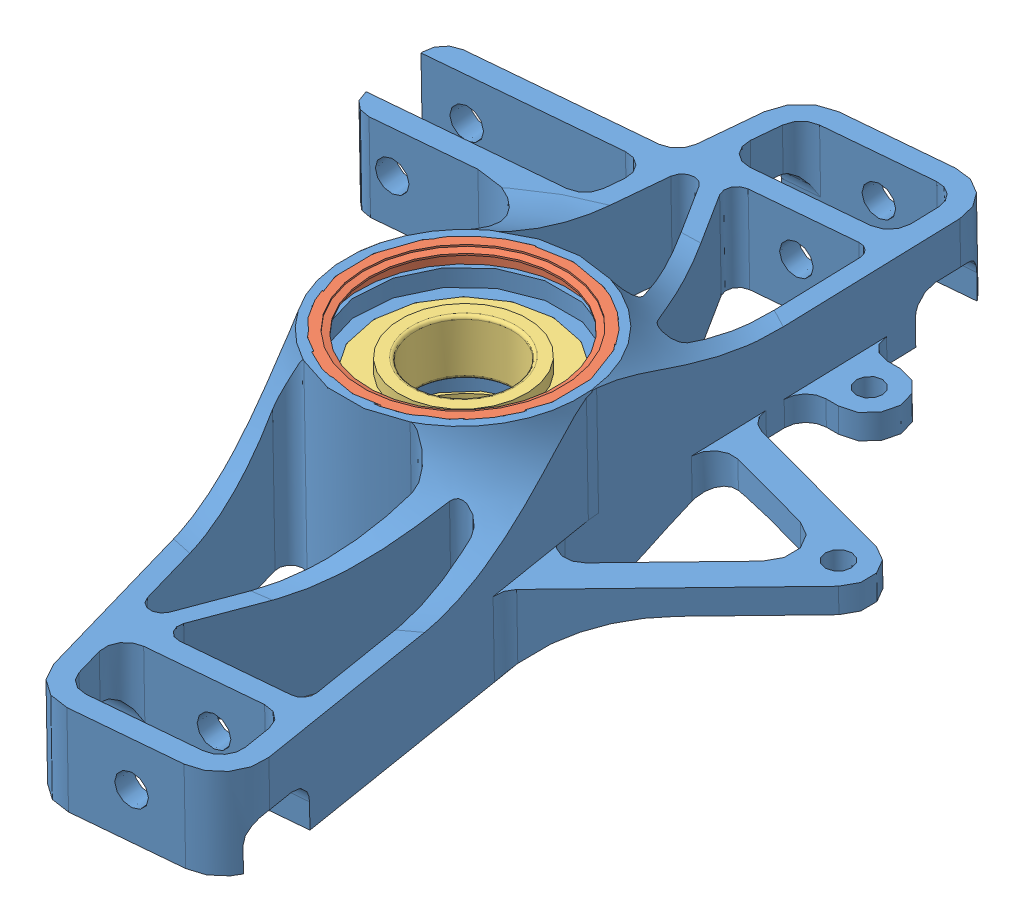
SolidWorks assembly Upright Assembly - Mirror_Final.SLDASM, configuration Default (file format 13000). Lengths in mm.
Overall size (187.69 75.94 260.67).
5 component instances, 3 part files, 8 mates.
Components (placement in the parent):
- Upright - Mirror_Final-1: Upright - Mirror_Final.SLDPRT [AP Caliper] at (-28.1936 -601.3602 -253.5794) size (187.69 75.94 260.67)
- Oil Seal_Final-1: Oil Seal_Final.SLDPRT [Default] at (-28.1936 8.8942 0.8085) x (0 -0.999848 -0.017452) z (-0.156462 -0.017237 0.987534) size (6.35 67.59 67.59)
- Oil Seal_Final-2: Oil Seal_Final.SLDPRT [Default] at (-28.1936 -47.6122 -0.1778) x (0 0.999848 0.017452) z (-0.017452 -0.01745 0.999695) size (6.35 67.59 67.59)
- Tapered Roller Bearing_Final-1: Tapered Roller Bearing_Final.SLDPRT [Default] at (-28.1936 -26.0254 0.199) x (0 -0.999848 -0.017452) z (0.934797 -0.006199 0.355129) size (17 55 55)
- Tapered Roller Bearing_Final-2: Tapered Roller Bearing_Final.SLDPRT [Default] at (-28.1936 -15.7273 0.3787) x (0 0.999848 0.017452) z (0.612483 -0.013796 0.790364) size (17 55 55)
Mates (geometry in assembly coordinates):
- Concentric8: concentric aligned: circle of Upright - Mirror_Final-1; cylinder of Oil Seal_Final-1 through (-28.1936 66.6872 1.8173) axis (0 0.999848 0.017452) radius 33.7947
- Coincident15: coincident aligned: plane of Upright - Mirror_Final-1 through (-155.1936 11.2758 -135.6291) normal (0 0.999848 0.017452); plane of Oil Seal_Final-1 through (2.1744 8.8103 5.6185) normal (0 0.999848 0.017452)
- Concentric9: concentric aligned: cylinder of Upright - Mirror_Final-1 through (-28.1936 -111.4075 -1.2914) axis (0 -0.999848 -0.017452) radius 33.782; cylinder of Oil Seal_Final-2 through (-28.1936 -105.4052 -1.1866) axis (0 -0.999848 -0.017452) radius 33.7947
- Coincident16: coincident aligned: plane of Upright - Mirror_Final-1 through (135.3262 -50.4622 163.1027) normal (0 -0.999848 -0.017452); plane of Oil Seal_Final-2 through (-58.9356 -47.6028 -0.7143) normal (0 -0.999848 -0.017452)
- Concentric10: concentric anti-aligned: cylinder of Upright - Mirror_Final-1 through (-28.1936 -111.4075 -1.2914) axis (0 -0.999848 -0.017452) radius 27.4999; cylinder of Tapered Roller Bearing_Final-1 through (-28.1936 -26.0254 0.199) axis (0 0.999848 0.017452) radius 27.5
- Coincident17: coincident anti-aligned: plane of Upright - Mirror_Final-1 through (-28.1936 -25.5455 -27.2968) normal (0 -0.999848 -0.017452); plane of Tapered Roller Bearing_Final-1 through (-19.6692 -25.6339 -22.2327) normal (0 0.999848 0.017452)
- Concentric12: concentric aligned: cylinder of Upright - Mirror_Final-1 through (-28.1936 -111.4075 -1.2914) axis (0 -0.999848 -0.017452) radius 27.4999; cylinder of Tapered Roller Bearing_Final-2 through (-28.1936 -15.7273 0.3787) axis (0 -0.999848 -0.017452) radius 27.5
- Coincident18: coincident anti-aligned: plane of Upright - Mirror_Final-1 through (-28.1936 -15.2917 -24.5774) normal (0 0.999848 0.017452); plane of Tapered Roller Bearing_Final-2 through (-47.1652 -15.9839 15.0761) normal (0 -0.999848 -0.017452)
